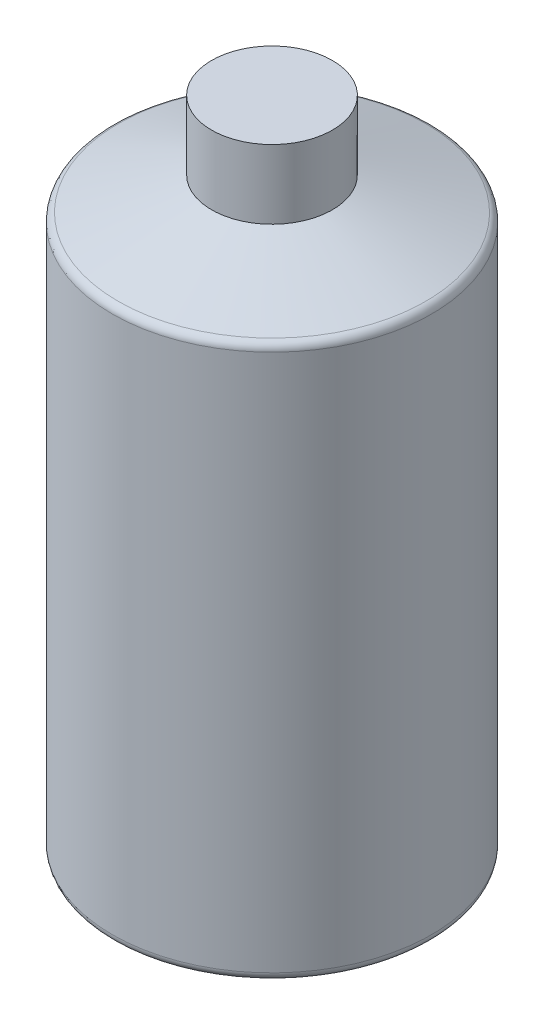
ISO-10303-21;
HEADER;
FILE_DESCRIPTION(('STEP AP214'),'2;1');
FILE_NAME('part.step','',(''),(''),'','','');
FILE_SCHEMA(('AUTOMOTIVE_DESIGN { 1 0 10303 214 1 1 1 1 }'));
ENDSEC;
DATA;
#1=APPLICATION_CONTEXT('core data for automotive mechanical design processes');
#2=APPLICATION_PROTOCOL_DEFINITION('international standard','automotive_design',2000,#1);
#3=PRODUCT_CONTEXT('',#1,'mechanical');
#4=PRODUCT('Part','Part','',(#3));
#5=PRODUCT_RELATED_PRODUCT_CATEGORY('part','',(#4));
#6=PRODUCT_DEFINITION_FORMATION('','',#4);
#7=PRODUCT_DEFINITION_CONTEXT('part definition',#1,'design');
#8=PRODUCT_DEFINITION('design','',#6,#7);
#9=PRODUCT_DEFINITION_SHAPE('','',#8);
#10=(LENGTH_UNIT() NAMED_UNIT(*) SI_UNIT(.MILLI.,.METRE.));
#11=(NAMED_UNIT(*) PLANE_ANGLE_UNIT() SI_UNIT($,.RADIAN.));
#12=(NAMED_UNIT(*) SI_UNIT($,.STERADIAN.) SOLID_ANGLE_UNIT());
#13=UNCERTAINTY_MEASURE_WITH_UNIT(LENGTH_MEASURE(1.E-05),#10,'distance_accuracy_value','');
#14=(GEOMETRIC_REPRESENTATION_CONTEXT(3) GLOBAL_UNCERTAINTY_ASSIGNED_CONTEXT((#13)) GLOBAL_UNIT_ASSIGNED_CONTEXT((#10,
#11,#12)) REPRESENTATION_CONTEXT('',''));
#15=CARTESIAN_POINT('',(0.,0.,0.));
#16=DIRECTION('',(0.,0.,1.));
#17=DIRECTION('',(1.,0.,0.));
#18=AXIS2_PLACEMENT_3D('',#15,#16,#17);
#19=CARTESIAN_POINT('',(0.,241.3,0.));
#20=DIRECTION('',(0.,-1.,0.));
#21=DIRECTION('',(0.,0.,-1.));
#22=AXIS2_PLACEMENT_3D('',#19,#20,#21);
#23=PLANE('',#22);
#24=CARTESIAN_POINT('',(0.,241.3,0.));
#25=DIRECTION('',(0.,-1.,0.));
#26=DIRECTION('',(0.,0.,-1.));
#27=AXIS2_PLACEMENT_3D('',#24,#25,#26);
#28=CIRCLE('',#27,22.225);
#29=CARTESIAN_POINT('',(0.,241.3,-22.225));
#30=VERTEX_POINT('',#29);
#31=EDGE_CURVE('E50',#30,#30,#28,.T.);
#32=ORIENTED_EDGE('',*,*,#31,.F.);
#33=EDGE_LOOP('',(#32));
#34=FACE_BOUND('',#33,.T.);
#35=ADVANCED_FACE('F30',(#34),#23,.F.);
#36=CARTESIAN_POINT('',(0.,0.,0.));
#37=DIRECTION('',(0.,-1.,0.));
#38=DIRECTION('',(0.,0.,-1.));
#39=AXIS2_PLACEMENT_3D('',#36,#37,#38);
#40=CYLINDRICAL_SURFACE('',#39,22.225);
#41=CARTESIAN_POINT('',(0.,215.9,0.));
#42=DIRECTION('',(0.,-1.,0.));
#43=DIRECTION('',(0.,0.,-1.));
#44=AXIS2_PLACEMENT_3D('',#41,#42,#43);
#45=CIRCLE('',#44,22.225);
#46=CARTESIAN_POINT('',(0.,215.9,-22.225));
#47=VERTEX_POINT('',#46);
#48=EDGE_CURVE('E53',#47,#47,#45,.T.);
#49=ORIENTED_EDGE('',*,*,#48,.F.);
#50=EDGE_LOOP('',(#49));
#51=FACE_BOUND('',#50,.T.);
#52=ORIENTED_EDGE('',*,*,#31,.T.);
#53=EDGE_LOOP('',(#52));
#54=FACE_BOUND('',#53,.T.);
#55=ADVANCED_FACE('F59',(#51,#54),#40,.T.);
#56=CARTESIAN_POINT('',(0.,215.9,0.));
#57=DIRECTION('',(0.,-1.,0.));
#58=DIRECTION('',(0.,0.,-1.));
#59=AXIS2_PLACEMENT_3D('',#56,#57,#58);
#60=CONICAL_SURFACE('',#59,22.225,1.23605948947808);
#61=CARTESIAN_POINT('',(0.,203.941546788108,0.));
#62=DIRECTION('',(0.,1.,0.));
#63=DIRECTION('',(0.,0.,1.));
#64=AXIS2_PLACEMENT_3D('',#61,#62,#63);
#65=CIRCLE('',#64,56.6055529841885);
#66=CARTESIAN_POINT('',(0.,203.941546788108,56.6055529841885));
#67=VERTEX_POINT('',#66);
#68=EDGE_CURVE('E10',#67,#67,#65,.T.);
#69=ORIENTED_EDGE('',*,*,#68,.T.);
#70=EDGE_LOOP('',(#69));
#71=FACE_BOUND('',#70,.T.);
#72=ORIENTED_EDGE('',*,*,#48,.T.);
#73=EDGE_LOOP('',(#72));
#74=FACE_BOUND('',#73,.T.);
#75=ADVANCED_FACE('F57',(#71,#74),#60,.T.);
#76=CARTESIAN_POINT('',(0.,0.,0.));
#77=DIRECTION('',(0.,-1.,0.));
#78=DIRECTION('',(0.,0.,-1.));
#79=AXIS2_PLACEMENT_3D('',#76,#77,#78);
#80=CYLINDRICAL_SURFACE('',#79,58.7375);
#81=CARTESIAN_POINT('',(0.,3.175,0.));
#82=DIRECTION('',(0.,1.,0.));
#83=DIRECTION('',(0.,0.,1.));
#84=AXIS2_PLACEMENT_3D('',#81,#82,#83);
#85=CIRCLE('',#84,58.7375);
#86=CARTESIAN_POINT('',(0.,3.175,58.7375));
#87=VERTEX_POINT('',#86);
#88=EDGE_CURVE('E37',#87,#87,#85,.T.);
#89=ORIENTED_EDGE('',*,*,#88,.T.);
#90=EDGE_LOOP('',(#89));
#91=FACE_BOUND('',#90,.T.);
#92=CARTESIAN_POINT('',(0.,200.942769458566,0.));
#93=DIRECTION('',(0.,1.,0.));
#94=DIRECTION('',(0.,0.,1.));
#95=AXIS2_PLACEMENT_3D('',#92,#93,#94);
#96=CIRCLE('',#95,58.7375);
#97=CARTESIAN_POINT('',(0.,200.942769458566,58.7375));
#98=VERTEX_POINT('',#97);
#99=EDGE_CURVE('E41',#98,#98,#96,.F.);
#100=ORIENTED_EDGE('',*,*,#99,.T.);
#101=EDGE_LOOP('',(#100));
#102=FACE_BOUND('',#101,.T.);
#103=ADVANCED_FACE('F79',(#91,#102),#80,.T.);
#104=CARTESIAN_POINT('',(-58.7375,0.,0.));
#105=DIRECTION('',(0.,1.,0.));
#106=DIRECTION('',(0.,0.,1.));
#107=AXIS2_PLACEMENT_3D('',#104,#105,#106);
#108=PLANE('',#107);
#109=CARTESIAN_POINT('',(0.,0.,0.));
#110=DIRECTION('',(0.,1.,0.));
#111=DIRECTION('',(0.,0.,1.));
#112=AXIS2_PLACEMENT_3D('',#109,#110,#111);
#113=CIRCLE('',#112,55.5625);
#114=CARTESIAN_POINT('',(0.,0.,55.5625));
#115=VERTEX_POINT('',#114);
#116=EDGE_CURVE('E45',#115,#115,#113,.F.);
#117=ORIENTED_EDGE('',*,*,#116,.T.);
#118=EDGE_LOOP('',(#117));
#119=FACE_BOUND('',#118,.T.);
#120=ADVANCED_FACE('F72',(#119),#108,.F.);
#121=CARTESIAN_POINT('',(0.,3.175,0.));
#122=DIRECTION('',(0.,1.,0.));
#123=DIRECTION('',(0.,0.,1.));
#124=AXIS2_PLACEMENT_3D('',#121,#122,#123);
#125=TOROIDAL_SURFACE('',#124,55.5625,3.175);
#126=ORIENTED_EDGE('',*,*,#88,.F.);
#127=EDGE_LOOP('',(#126));
#128=FACE_BOUND('',#127,.T.);
#129=ORIENTED_EDGE('',*,*,#116,.F.);
#130=EDGE_LOOP('',(#129));
#131=FACE_BOUND('',#130,.T.);
#132=ADVANCED_FACE('F70',(#128,#131),#125,.T.);
#133=CARTESIAN_POINT('',(0.,200.942769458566,0.));
#134=DIRECTION('',(0.,1.,0.));
#135=DIRECTION('',(0.,0.,1.));
#136=AXIS2_PLACEMENT_3D('',#133,#134,#135);
#137=TOROIDAL_SURFACE('',#136,55.5625,3.175);
#138=ORIENTED_EDGE('',*,*,#68,.F.);
#139=EDGE_LOOP('',(#138));
#140=FACE_BOUND('',#139,.T.);
#141=ORIENTED_EDGE('',*,*,#99,.F.);
#142=EDGE_LOOP('',(#141));
#143=FACE_BOUND('',#142,.T.);
#144=ADVANCED_FACE('F32',(#140,#143),#137,.T.);
#145=CLOSED_SHELL('',(#35,#55,#75,#103,#120,#132,#144));
#146=MANIFOLD_SOLID_BREP('B2',#145);
#147=ADVANCED_BREP_SHAPE_REPRESENTATION('',(#18,#146),#14);
#148=SHAPE_DEFINITION_REPRESENTATION(#9,#147);
ENDSEC;
END-ISO-10303-21;
